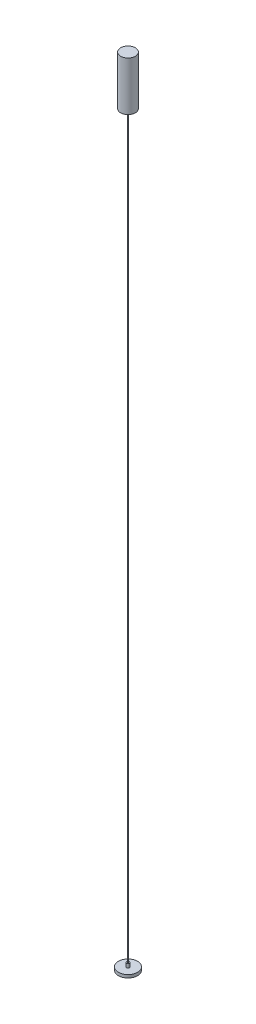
from build123d import *

# Parameters (mm, degrees)
CROQUIS1_R              = 39
SALIENTE_EXTRUIR1_DEPTH = 12
CROQUIS2_R              = 6
SALIENTE_EXTRUIR2_DEPTH = 15
CROQUIS3_R              = 2
SALIENTE_EXTRUIR3_DEPTH = 3000
CROQUIS4_R              = 6
SALIENTE_EXTRUIR4_DEPTH = 15
CROQUIS5_R              = 30
SALIENTE_EXTRUIR5_DEPTH = 200


with BuildPart() as part:
    # Croquis1 → Saliente-Extruir1 (new body)
    with BuildSketch(Plane(origin=(0, 0, 0), x_dir=(1, 0, 0), z_dir=(0, 1, 0))):
        with Locations(Location((0, 0, 0), (0, 0, 270))):
            Circle(CROQUIS1_R)
    extrude(amount=SALIENTE_EXTRUIR1_DEPTH)


with BuildPart() as body_2:
    # Croquis2 → Saliente-Extruir2 (new body)
    with BuildSketch(Plane(origin=(0, 12, 0), x_dir=(1, 0, 0), z_dir=(0, 1, 0))):
        with Locations(Location((0, 0, 0), (0, 0, 270))):
            Circle(CROQUIS2_R)
    extrude(amount=SALIENTE_EXTRUIR2_DEPTH)


with BuildPart() as body_3:
    # Croquis3 → Saliente-Extruir3 (new body)
    with BuildSketch(Plane(origin=(0, 27, 0), x_dir=(1, 0, 0), z_dir=(0, 1, 0))):
        with Locations(Location((0, 0, 0), (0, 0, 270))):
            Circle(CROQUIS3_R)
    extrude(amount=SALIENTE_EXTRUIR3_DEPTH)


with BuildPart() as body_4:
    # Croquis4 → Saliente-Extruir4 (new body)
    with BuildSketch(Plane(origin=(0, 3027, 0), x_dir=(1, 0, 0), z_dir=(0, 1, 0))):
        with Locations(Location((-0.223517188, 0, 0), (0, 0, 270))):
            Circle(CROQUIS4_R)
    extrude(amount=SALIENTE_EXTRUIR4_DEPTH)


with BuildPart() as body_5:
    # Croquis5 → Saliente-Extruir5 (new body)
    with BuildSketch(Plane(origin=(0, 3042, 0), x_dir=(1, 0, 0), z_dir=(0, 1, 0))):
        with Locations(Location((0, 0, 0), (0, 0, 270))):
            Circle(CROQUIS5_R)
    extrude(amount=SALIENTE_EXTRUIR5_DEPTH)


solid = Compound([part.part, body_2.part, body_3.part, body_4.part, body_5.part])
